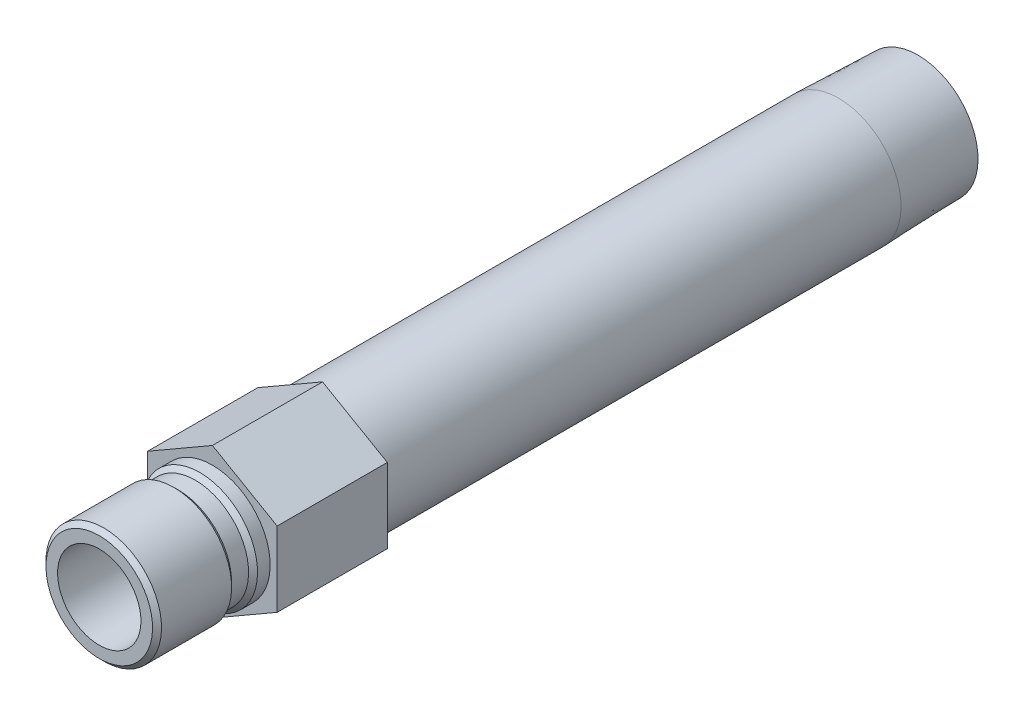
from build123d import *

# Parameters (mm, degrees)
SKETCH2_R           = 7.112
BOSS_EXTRUDE1_DEPTH = 18.796


with BuildPart() as part:
    # Sketch1 → Revolve1 (revolve)
    with BuildSketch(Plane(origin=(0, 0, 0), x_dir=(0, 0, -1), z_dir=(1, 0, 0))):
        Polygon((-19.304, 7.112), (-19.304, 9.0932), (-18.542, 9.8552), (-6.5786, 9.8552), (-5.8166, 9.0932), (-2.921, 9.0932), (-2.159, 9.8552), (0, 9.8552), (0, 10.668), (106.8324, 10.668), (120.396, 10.244140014), (120.396, 7.8994), (-1.105331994, 7.8994), (-1.524, 7.112), align=None)
    revolve(axis=Axis((0, 0, 0), (0, 0, 1)))

    # Sketch2 → Boss-Extrude1 (add)
    with BuildSketch(Plane.XY):
        Polygon((-11.049, 6.379143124), (-11.049, -6.379143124), (0, -12.758286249), (11.049, -6.379143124), (11.049, 6.379143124), (0, 12.758286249), align=None)
        with Locations(Location((0, 0, 0), (0, 0, 90))):
            Circle(SKETCH2_R, mode=Mode.SUBTRACT)
    extrude(amount=-BOSS_EXTRUDE1_DEPTH)


solid = part.part
